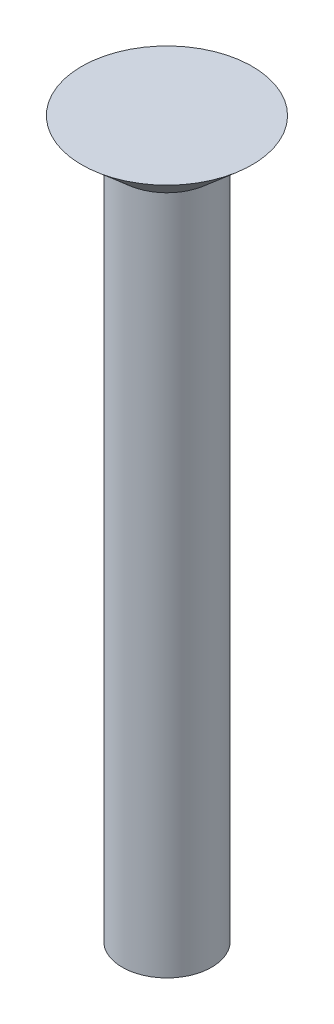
ISO-10303-21;
HEADER;
FILE_DESCRIPTION(('STEP AP214'),'2;1');
FILE_NAME('part.step','',(''),(''),'','','');
FILE_SCHEMA(('AUTOMOTIVE_DESIGN { 1 0 10303 214 1 1 1 1 }'));
ENDSEC;
DATA;
#1=APPLICATION_CONTEXT('core data for automotive mechanical design processes');
#2=APPLICATION_PROTOCOL_DEFINITION('international standard','automotive_design',2000,#1);
#3=PRODUCT_CONTEXT('',#1,'mechanical');
#4=PRODUCT('Part','Part','',(#3));
#5=PRODUCT_RELATED_PRODUCT_CATEGORY('part','',(#4));
#6=PRODUCT_DEFINITION_FORMATION('','',#4);
#7=PRODUCT_DEFINITION_CONTEXT('part definition',#1,'design');
#8=PRODUCT_DEFINITION('design','',#6,#7);
#9=PRODUCT_DEFINITION_SHAPE('','',#8);
#10=(LENGTH_UNIT() NAMED_UNIT(*) SI_UNIT(.MILLI.,.METRE.));
#11=(NAMED_UNIT(*) PLANE_ANGLE_UNIT() SI_UNIT($,.RADIAN.));
#12=(NAMED_UNIT(*) SI_UNIT($,.STERADIAN.) SOLID_ANGLE_UNIT());
#13=UNCERTAINTY_MEASURE_WITH_UNIT(LENGTH_MEASURE(1.E-05),#10,'distance_accuracy_value','');
#14=(GEOMETRIC_REPRESENTATION_CONTEXT(3) GLOBAL_UNCERTAINTY_ASSIGNED_CONTEXT((#13)) GLOBAL_UNIT_ASSIGNED_CONTEXT((#10,
#11,#12)) REPRESENTATION_CONTEXT('',''));
#15=CARTESIAN_POINT('',(0.,0.,0.));
#16=DIRECTION('',(0.,0.,1.));
#17=DIRECTION('',(1.,0.,0.));
#18=AXIS2_PLACEMENT_3D('',#15,#16,#17);
#19=CARTESIAN_POINT('',(0.,0.,0.));
#20=DIRECTION('',(0.,-1.,0.));
#21=DIRECTION('',(1.,0.,0.));
#22=AXIS2_PLACEMENT_3D('',#19,#20,#21);
#23=PLANE('',#22);
#24=CARTESIAN_POINT('',(0.,0.,0.));
#25=DIRECTION('',(0.,1.,0.));
#26=DIRECTION('',(-1.,0.,0.));
#27=AXIS2_PLACEMENT_3D('',#24,#25,#26);
#28=CIRCLE('',#27,6.0579);
#29=CARTESIAN_POINT('',(-6.0579,0.,0.));
#30=VERTEX_POINT('',#29);
#31=EDGE_CURVE('E10',#30,#30,#28,.T.);
#32=ORIENTED_EDGE('',*,*,#31,.T.);
#33=EDGE_LOOP('',(#32));
#34=FACE_BOUND('',#33,.T.);
#35=ADVANCED_FACE('F35',(#34),#23,.F.);
#36=CARTESIAN_POINT('',(0.,-2.50606673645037,0.));
#37=DIRECTION('',(0.,1.,0.));
#38=DIRECTION('',(-1.,0.,0.));
#39=AXIS2_PLACEMENT_3D('',#36,#37,#38);
#40=CONICAL_SURFACE('',#39,3.175,0.855211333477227);
#41=ORIENTED_EDGE('',*,*,#31,.F.);
#42=EDGE_LOOP('',(#41));
#43=FACE_BOUND('',#42,.T.);
#44=CARTESIAN_POINT('',(0.,-2.50606673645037,0.));
#45=DIRECTION('',(0.,1.,0.));
#46=DIRECTION('',(-1.,0.,0.));
#47=AXIS2_PLACEMENT_3D('',#44,#45,#46);
#48=CIRCLE('',#47,3.175);
#49=CARTESIAN_POINT('',(-3.175,-2.50606673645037,0.));
#50=VERTEX_POINT('',#49);
#51=EDGE_CURVE('E42',#50,#50,#48,.T.);
#52=ORIENTED_EDGE('',*,*,#51,.T.);
#53=EDGE_LOOP('',(#52));
#54=FACE_BOUND('',#53,.T.);
#55=ADVANCED_FACE('F62',(#43,#54),#40,.T.);
#56=CARTESIAN_POINT('',(0.,0.,0.));
#57=DIRECTION('',(0.,1.,0.));
#58=DIRECTION('',(-1.,0.,0.));
#59=AXIS2_PLACEMENT_3D('',#56,#57,#58);
#60=CYLINDRICAL_SURFACE('',#59,3.175);
#61=ORIENTED_EDGE('',*,*,#51,.F.);
#62=EDGE_LOOP('',(#61));
#63=FACE_BOUND('',#62,.T.);
#64=CARTESIAN_POINT('',(0.,-50.8,0.));
#65=DIRECTION('',(0.,1.,0.));
#66=DIRECTION('',(-1.,0.,0.));
#67=AXIS2_PLACEMENT_3D('',#64,#65,#66);
#68=CIRCLE('',#67,3.175);
#69=CARTESIAN_POINT('',(-3.17499999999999,-50.8,0.));
#70=VERTEX_POINT('',#69);
#71=EDGE_CURVE('E47',#70,#70,#68,.T.);
#72=ORIENTED_EDGE('',*,*,#71,.T.);
#73=EDGE_LOOP('',(#72));
#74=FACE_BOUND('',#73,.T.);
#75=ADVANCED_FACE('F54',(#63,#74),#60,.T.);
#76=CARTESIAN_POINT('',(3.17500000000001,-50.8,0.));
#77=DIRECTION('',(0.,1.,0.));
#78=DIRECTION('',(-1.,0.,0.));
#79=AXIS2_PLACEMENT_3D('',#76,#77,#78);
#80=PLANE('',#79);
#81=ORIENTED_EDGE('',*,*,#71,.F.);
#82=EDGE_LOOP('',(#81));
#83=FACE_BOUND('',#82,.T.);
#84=ADVANCED_FACE('F56',(#83),#80,.F.);
#85=CLOSED_SHELL('',(#35,#55,#75,#84));
#86=MANIFOLD_SOLID_BREP('B2',#85);
#87=ADVANCED_BREP_SHAPE_REPRESENTATION('',(#18,#86),#14);
#88=SHAPE_DEFINITION_REPRESENTATION(#9,#87);
ENDSEC;
END-ISO-10303-21;
